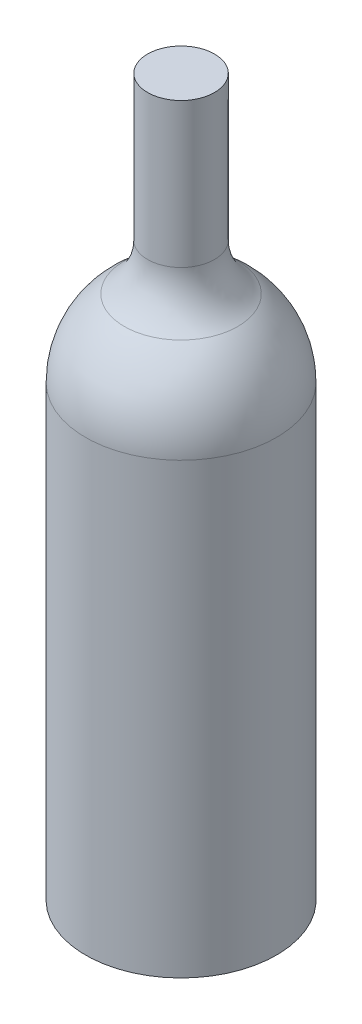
from build123d import *


with BuildPart() as part:
    # Sketch1 → Revolve1 (revolve)
    with BuildSketch(Plane.XY, mode=Mode.PRIVATE) as revolve1_sk:
        with BuildLine():
            Line((0, 300), (14, 300))
            Line((14, 300), (14, 239.405136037))
            ThreePointArc((14, 239.405136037), (16.584439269, 228.539005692), (23.784265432, 220))
            ThreePointArc((23.784265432, 220), (35.716737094, 205.848068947), (40, 187.839329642))
            Line((40, 187.839329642), (40, 0))
            Line((40, 0), (0, 0))
            Line((0, 0), (0, 300))
        make_face()
    revolve(revolve1_sk.sketch.rotate(Axis((0, 0, 0), (0, 1, 0)), 90), axis=Axis((0, 0, 0), (0, 1, 0)))


solid = part.part
